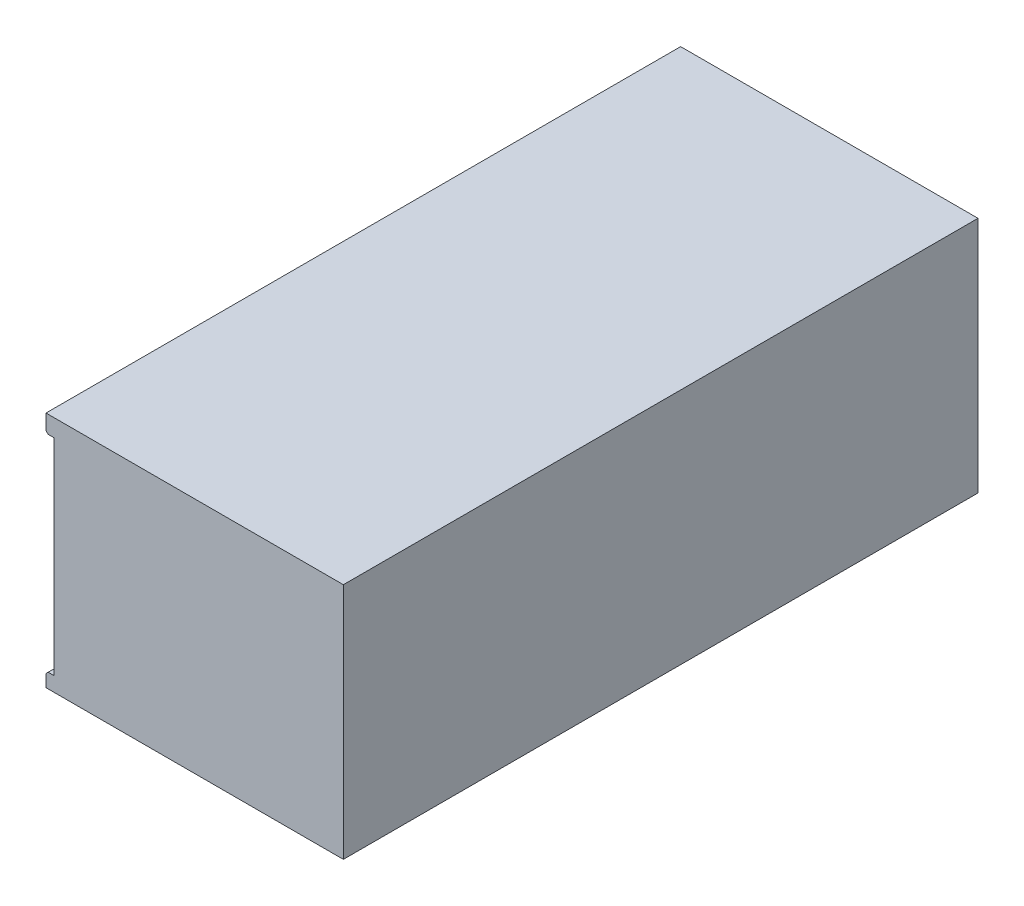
ISO-10303-21;
HEADER;
FILE_DESCRIPTION(('STEP AP214'),'2;1');
FILE_NAME('part.step','',(''),(''),'','','');
FILE_SCHEMA(('AUTOMOTIVE_DESIGN { 1 0 10303 214 1 1 1 1 }'));
ENDSEC;
DATA;
#1=APPLICATION_CONTEXT('core data for automotive mechanical design processes');
#2=APPLICATION_PROTOCOL_DEFINITION('international standard','automotive_design',2000,#1);
#3=PRODUCT_CONTEXT('',#1,'mechanical');
#4=PRODUCT('Part','Part','',(#3));
#5=PRODUCT_RELATED_PRODUCT_CATEGORY('part','',(#4));
#6=PRODUCT_DEFINITION_FORMATION('','',#4);
#7=PRODUCT_DEFINITION_CONTEXT('part definition',#1,'design');
#8=PRODUCT_DEFINITION('design','',#6,#7);
#9=PRODUCT_DEFINITION_SHAPE('','',#8);
#10=(LENGTH_UNIT() NAMED_UNIT(*) SI_UNIT(.MILLI.,.METRE.));
#11=(NAMED_UNIT(*) PLANE_ANGLE_UNIT() SI_UNIT($,.RADIAN.));
#12=(NAMED_UNIT(*) SI_UNIT($,.STERADIAN.) SOLID_ANGLE_UNIT());
#13=UNCERTAINTY_MEASURE_WITH_UNIT(LENGTH_MEASURE(1.E-05),#10,'distance_accuracy_value','');
#14=(GEOMETRIC_REPRESENTATION_CONTEXT(3) GLOBAL_UNCERTAINTY_ASSIGNED_CONTEXT((#13)) GLOBAL_UNIT_ASSIGNED_CONTEXT((#10,
#11,#12)) REPRESENTATION_CONTEXT('',''));
#15=CARTESIAN_POINT('',(0.,0.,0.));
#16=DIRECTION('',(0.,0.,1.));
#17=DIRECTION('',(1.,0.,0.));
#18=AXIS2_PLACEMENT_3D('',#15,#16,#17);
#19=CARTESIAN_POINT('',(-1.397,0.,55.5625));
#20=DIRECTION('',(0.,-1.,0.));
#21=DIRECTION('',(0.,0.,-1.));
#22=AXIS2_PLACEMENT_3D('',#19,#20,#21);
#23=PLANE('',#22);
#24=DIRECTION('',(-1.,0.,0.));
#25=VECTOR('',#24,1.);
#26=CARTESIAN_POINT('',(-1.397,0.,-55.5625));
#27=LINE('',#26,#25);
#28=CARTESIAN_POINT('',(50.673,0.,-55.5625));
#29=VERTEX_POINT('',#28);
#30=CARTESIAN_POINT('',(-1.397,0.,-55.5625));
#31=VERTEX_POINT('',#30);
#32=EDGE_CURVE('E240',#29,#31,#27,.T.);
#33=ORIENTED_EDGE('',*,*,#32,.T.);
#34=DIRECTION('',(0.,0.,-1.));
#35=VECTOR('',#34,1.);
#36=CARTESIAN_POINT('',(-1.397,0.,55.5625));
#37=LINE('',#36,#35);
#38=CARTESIAN_POINT('',(-1.397,0.,55.5625));
#39=VERTEX_POINT('',#38);
#40=EDGE_CURVE('E291',#39,#31,#37,.T.);
#41=ORIENTED_EDGE('',*,*,#40,.F.);
#42=DIRECTION('',(-1.,0.,0.));
#43=VECTOR('',#42,1.);
#44=CARTESIAN_POINT('',(-1.397,0.,55.5625));
#45=LINE('',#44,#43);
#46=CARTESIAN_POINT('',(50.673,0.,55.5625));
#47=VERTEX_POINT('',#46);
#48=EDGE_CURVE('E241',#47,#39,#45,.T.);
#49=ORIENTED_EDGE('',*,*,#48,.F.);
#50=DIRECTION('',(0.,0.,-1.));
#51=VECTOR('',#50,1.);
#52=CARTESIAN_POINT('',(50.673,0.,55.5625));
#53=LINE('',#52,#51);
#54=EDGE_CURVE('E260',#47,#29,#53,.T.);
#55=ORIENTED_EDGE('',*,*,#54,.T.);
#56=EDGE_LOOP('',(#33,#41,#49,#55));
#57=FACE_BOUND('',#56,.T.);
#58=ADVANCED_FACE('F37',(#57),#23,.F.);
#59=CARTESIAN_POINT('',(-1.397,-3.048,55.5625));
#60=DIRECTION('',(1.,0.,0.));
#61=DIRECTION('',(0.,0.,-1.));
#62=AXIS2_PLACEMENT_3D('',#59,#60,#61);
#63=PLANE('',#62);
#64=DIRECTION('',(0.,-1.,0.));
#65=VECTOR('',#64,1.);
#66=CARTESIAN_POINT('',(-1.397,-3.048,-55.5625));
#67=LINE('',#66,#65);
#68=CARTESIAN_POINT('',(-1.397,-2.66700000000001,-55.5625));
#69=VERTEX_POINT('',#68);
#70=EDGE_CURVE('E263',#31,#69,#67,.T.);
#71=ORIENTED_EDGE('',*,*,#70,.T.);
#72=DIRECTION('',(0.,0.,1.));
#73=VECTOR('',#72,1.);
#74=CARTESIAN_POINT('',(-1.397,-2.66700000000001,55.5625));
#75=LINE('',#74,#73);
#76=CARTESIAN_POINT('',(-1.397,-2.66700000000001,55.5625));
#77=VERTEX_POINT('',#76);
#78=EDGE_CURVE('E11',#69,#77,#75,.T.);
#79=ORIENTED_EDGE('',*,*,#78,.T.);
#80=DIRECTION('',(0.,-1.,0.));
#81=VECTOR('',#80,1.);
#82=CARTESIAN_POINT('',(-1.397,-3.048,55.5625));
#83=LINE('',#82,#81);
#84=EDGE_CURVE('E244',#39,#77,#83,.T.);
#85=ORIENTED_EDGE('',*,*,#84,.F.);
#86=ORIENTED_EDGE('',*,*,#40,.T.);
#87=EDGE_LOOP('',(#71,#79,#85,#86));
#88=FACE_BOUND('',#87,.T.);
#89=ADVANCED_FACE('F347',(#88),#63,.F.);
#90=CARTESIAN_POINT('',(0.,-3.048,55.5625));
#91=DIRECTION('',(0.,1.,0.));
#92=DIRECTION('',(0.,0.,1.));
#93=AXIS2_PLACEMENT_3D('',#90,#91,#92);
#94=PLANE('',#93);
#95=DIRECTION('',(1.,0.,0.));
#96=VECTOR('',#95,1.);
#97=CARTESIAN_POINT('',(0.,-3.048,55.5625));
#98=LINE('',#97,#96);
#99=CARTESIAN_POINT('',(-1.016,-3.048,55.5625));
#100=VERTEX_POINT('',#99);
#101=CARTESIAN_POINT('',(0.,-3.048,55.5625));
#102=VERTEX_POINT('',#101);
#103=EDGE_CURVE('E247',#100,#102,#98,.T.);
#104=ORIENTED_EDGE('',*,*,#103,.F.);
#105=DIRECTION('',(0.,0.,-1.));
#106=VECTOR('',#105,1.);
#107=CARTESIAN_POINT('',(-1.016,-3.048,55.5625));
#108=LINE('',#107,#106);
#109=CARTESIAN_POINT('',(-1.016,-3.048,-55.5625));
#110=VERTEX_POINT('',#109);
#111=EDGE_CURVE('E45',#100,#110,#108,.T.);
#112=ORIENTED_EDGE('',*,*,#111,.T.);
#113=DIRECTION('',(1.,0.,0.));
#114=VECTOR('',#113,1.);
#115=CARTESIAN_POINT('',(0.,-3.048,-55.5625));
#116=LINE('',#115,#114);
#117=CARTESIAN_POINT('',(0.,-3.048,-55.5625));
#118=VERTEX_POINT('',#117);
#119=EDGE_CURVE('E265',#110,#118,#116,.T.);
#120=ORIENTED_EDGE('',*,*,#119,.T.);
#121=DIRECTION('',(0.,0.,-1.));
#122=VECTOR('',#121,1.);
#123=CARTESIAN_POINT('',(0.,-3.048,55.5625));
#124=LINE('',#123,#122);
#125=EDGE_CURVE('E288',#102,#118,#124,.T.);
#126=ORIENTED_EDGE('',*,*,#125,.F.);
#127=EDGE_LOOP('',(#104,#112,#120,#126));
#128=FACE_BOUND('',#127,.T.);
#129=ADVANCED_FACE('F309',(#128),#94,.F.);
#130=CARTESIAN_POINT('',(0.,-39.116,55.5625));
#131=DIRECTION('',(1.,0.,0.));
#132=DIRECTION('',(0.,0.,-1.));
#133=AXIS2_PLACEMENT_3D('',#130,#131,#132);
#134=PLANE('',#133);
#135=CARTESIAN_POINT('',(0.,-6.34999999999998,-50.2666));
#136=DIRECTION('',(-1.,0.,0.));
#137=DIRECTION('',(0.,0.,1.));
#138=AXIS2_PLACEMENT_3D('',#135,#136,#137);
#139=CIRCLE('',#138,2.413);
#140=CARTESIAN_POINT('',(0.,-6.34999999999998,-47.8536));
#141=VERTEX_POINT('',#140);
#142=EDGE_CURVE('E153',#141,#141,#139,.T.);
#143=ORIENTED_EDGE('',*,*,#142,.F.);
#144=EDGE_LOOP('',(#143));
#145=FACE_BOUND('',#144,.T.);
#146=CARTESIAN_POINT('',(0.,-6.35000000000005,50.2666));
#147=DIRECTION('',(-1.,0.,0.));
#148=DIRECTION('',(0.,0.,1.));
#149=AXIS2_PLACEMENT_3D('',#146,#147,#148);
#150=CIRCLE('',#149,2.413);
#151=CARTESIAN_POINT('',(0.,-6.35000000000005,52.6796));
#152=VERTEX_POINT('',#151);
#153=EDGE_CURVE('E165',#152,#152,#150,.T.);
#154=ORIENTED_EDGE('',*,*,#153,.F.);
#155=EDGE_LOOP('',(#154));
#156=FACE_BOUND('',#155,.T.);
#157=CARTESIAN_POINT('',(0.,-6.35000000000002,4.8768));
#158=DIRECTION('',(-1.,0.,0.));
#159=DIRECTION('',(0.,0.,1.));
#160=AXIS2_PLACEMENT_3D('',#157,#158,#159);
#161=CIRCLE('',#160,2.413);
#162=CARTESIAN_POINT('',(0.,-6.35000000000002,7.28979999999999));
#163=VERTEX_POINT('',#162);
#164=EDGE_CURVE('E177',#163,#163,#161,.T.);
#165=ORIENTED_EDGE('',*,*,#164,.F.);
#166=EDGE_LOOP('',(#165));
#167=FACE_BOUND('',#166,.T.);
#168=CARTESIAN_POINT('',(0.,-6.35000000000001,-4.8768));
#169=DIRECTION('',(-1.,0.,0.));
#170=DIRECTION('',(0.,0.,1.));
#171=AXIS2_PLACEMENT_3D('',#168,#169,#170);
#172=CIRCLE('',#171,2.413);
#173=CARTESIAN_POINT('',(0.,-6.35000000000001,-2.4638));
#174=VERTEX_POINT('',#173);
#175=EDGE_CURVE('E189',#174,#174,#172,.T.);
#176=ORIENTED_EDGE('',*,*,#175,.F.);
#177=EDGE_LOOP('',(#176));
#178=FACE_BOUND('',#177,.T.);
#179=CARTESIAN_POINT('',(0.,-35.814,-50.2666));
#180=DIRECTION('',(-1.,0.,0.));
#181=DIRECTION('',(0.,0.,1.));
#182=AXIS2_PLACEMENT_3D('',#179,#180,#181);
#183=CIRCLE('',#182,2.413);
#184=CARTESIAN_POINT('',(0.,-35.814,-47.8536));
#185=VERTEX_POINT('',#184);
#186=EDGE_CURVE('E201',#185,#185,#183,.T.);
#187=ORIENTED_EDGE('',*,*,#186,.F.);
#188=EDGE_LOOP('',(#187));
#189=FACE_BOUND('',#188,.T.);
#190=CARTESIAN_POINT('',(0.,-35.814,-4.87680000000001));
#191=DIRECTION('',(-1.,0.,0.));
#192=DIRECTION('',(0.,0.,1.));
#193=AXIS2_PLACEMENT_3D('',#190,#191,#192);
#194=CIRCLE('',#193,2.413);
#195=CARTESIAN_POINT('',(0.,-35.814,-2.46380000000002));
#196=VERTEX_POINT('',#195);
#197=EDGE_CURVE('E213',#196,#196,#194,.T.);
#198=ORIENTED_EDGE('',*,*,#197,.F.);
#199=EDGE_LOOP('',(#198));
#200=FACE_BOUND('',#199,.T.);
#201=CARTESIAN_POINT('',(0.,-35.814,4.87679999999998));
#202=DIRECTION('',(-1.,0.,0.));
#203=DIRECTION('',(0.,0.,1.));
#204=AXIS2_PLACEMENT_3D('',#201,#202,#203);
#205=CIRCLE('',#204,2.413);
#206=CARTESIAN_POINT('',(0.,-35.814,7.28979999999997));
#207=VERTEX_POINT('',#206);
#208=EDGE_CURVE('E225',#207,#207,#205,.T.);
#209=ORIENTED_EDGE('',*,*,#208,.F.);
#210=EDGE_LOOP('',(#209));
#211=FACE_BOUND('',#210,.T.);
#212=CARTESIAN_POINT('',(0.,-35.814,50.2666));
#213=DIRECTION('',(-1.,0.,0.));
#214=DIRECTION('',(0.,0.,1.));
#215=AXIS2_PLACEMENT_3D('',#212,#213,#214);
#216=CIRCLE('',#215,2.413);
#217=CARTESIAN_POINT('',(0.,-35.814,52.6796));
#218=VERTEX_POINT('',#217);
#219=EDGE_CURVE('E237',#218,#218,#216,.T.);
#220=ORIENTED_EDGE('',*,*,#219,.F.);
#221=EDGE_LOOP('',(#220));
#222=FACE_BOUND('',#221,.T.);
#223=DIRECTION('',(0.,-1.,0.));
#224=VECTOR('',#223,1.);
#225=CARTESIAN_POINT('',(0.,-39.116,-55.5625));
#226=LINE('',#225,#224);
#227=CARTESIAN_POINT('',(0.,-39.116,-55.5625));
#228=VERTEX_POINT('',#227);
#229=EDGE_CURVE('E267',#118,#228,#226,.T.);
#230=ORIENTED_EDGE('',*,*,#229,.T.);
#231=DIRECTION('',(0.,0.,-1.));
#232=VECTOR('',#231,1.);
#233=CARTESIAN_POINT('',(0.,-39.116,55.5625));
#234=LINE('',#233,#232);
#235=CARTESIAN_POINT('',(0.,-39.116,55.5625));
#236=VERTEX_POINT('',#235);
#237=EDGE_CURVE('E285',#236,#228,#234,.T.);
#238=ORIENTED_EDGE('',*,*,#237,.F.);
#239=DIRECTION('',(0.,-1.,0.));
#240=VECTOR('',#239,1.);
#241=CARTESIAN_POINT('',(0.,-39.116,55.5625));
#242=LINE('',#241,#240);
#243=EDGE_CURVE('E249',#102,#236,#242,.T.);
#244=ORIENTED_EDGE('',*,*,#243,.F.);
#245=ORIENTED_EDGE('',*,*,#125,.T.);
#246=EDGE_LOOP('',(#230,#238,#244,#245));
#247=FACE_BOUND('',#246,.T.);
#248=ADVANCED_FACE('F319',(#145,#156,#167,#178,#189,#200,#211,#222,#247),#134,.F.);
#249=CARTESIAN_POINT('',(-1.397,-39.116,55.5625));
#250=DIRECTION('',(0.,-1.,0.));
#251=DIRECTION('',(0.,0.,-1.));
#252=AXIS2_PLACEMENT_3D('',#249,#250,#251);
#253=PLANE('',#252);
#254=DIRECTION('',(-1.,0.,0.));
#255=VECTOR('',#254,1.);
#256=CARTESIAN_POINT('',(-1.397,-39.116,-55.5625));
#257=LINE('',#256,#255);
#258=CARTESIAN_POINT('',(-1.01599999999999,-39.116,-55.5625));
#259=VERTEX_POINT('',#258);
#260=EDGE_CURVE('E269',#228,#259,#257,.T.);
#261=ORIENTED_EDGE('',*,*,#260,.T.);
#262=DIRECTION('',(0.,0.,1.));
#263=VECTOR('',#262,1.);
#264=CARTESIAN_POINT('',(-1.01599999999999,-39.116,55.5625));
#265=LINE('',#264,#263);
#266=CARTESIAN_POINT('',(-1.01599999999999,-39.116,55.5625));
#267=VERTEX_POINT('',#266);
#268=EDGE_CURVE('E301',#259,#267,#265,.T.);
#269=ORIENTED_EDGE('',*,*,#268,.T.);
#270=DIRECTION('',(-1.,0.,0.));
#271=VECTOR('',#270,1.);
#272=CARTESIAN_POINT('',(-1.397,-39.116,55.5625));
#273=LINE('',#272,#271);
#274=EDGE_CURVE('E251',#236,#267,#273,.T.);
#275=ORIENTED_EDGE('',*,*,#274,.F.);
#276=ORIENTED_EDGE('',*,*,#237,.T.);
#277=EDGE_LOOP('',(#261,#269,#275,#276));
#278=FACE_BOUND('',#277,.T.);
#279=ADVANCED_FACE('F323',(#278),#253,.F.);
#280=CARTESIAN_POINT('',(-1.397,-41.656,55.5625));
#281=DIRECTION('',(1.,0.,0.));
#282=DIRECTION('',(0.,0.,-1.));
#283=AXIS2_PLACEMENT_3D('',#280,#281,#282);
#284=PLANE('',#283);
#285=DIRECTION('',(0.,-1.,0.));
#286=VECTOR('',#285,1.);
#287=CARTESIAN_POINT('',(-1.397,-41.656,55.5625));
#288=LINE('',#287,#286);
#289=CARTESIAN_POINT('',(-1.397,-39.497,55.5625));
#290=VERTEX_POINT('',#289);
#291=CARTESIAN_POINT('',(-1.397,-41.656,55.5625));
#292=VERTEX_POINT('',#291);
#293=EDGE_CURVE('E254',#290,#292,#288,.T.);
#294=ORIENTED_EDGE('',*,*,#293,.F.);
#295=DIRECTION('',(0.,0.,-1.));
#296=VECTOR('',#295,1.);
#297=CARTESIAN_POINT('',(-1.397,-39.497,55.5625));
#298=LINE('',#297,#296);
#299=CARTESIAN_POINT('',(-1.397,-39.497,-55.5625));
#300=VERTEX_POINT('',#299);
#301=EDGE_CURVE('E294',#290,#300,#298,.T.);
#302=ORIENTED_EDGE('',*,*,#301,.T.);
#303=DIRECTION('',(0.,-1.,0.));
#304=VECTOR('',#303,1.);
#305=CARTESIAN_POINT('',(-1.397,-41.656,-55.5625));
#306=LINE('',#305,#304);
#307=CARTESIAN_POINT('',(-1.397,-41.656,-55.5625));
#308=VERTEX_POINT('',#307);
#309=EDGE_CURVE('E272',#300,#308,#306,.T.);
#310=ORIENTED_EDGE('',*,*,#309,.T.);
#311=DIRECTION('',(0.,0.,-1.));
#312=VECTOR('',#311,1.);
#313=CARTESIAN_POINT('',(-1.397,-41.656,55.5625));
#314=LINE('',#313,#312);
#315=EDGE_CURVE('E282',#292,#308,#314,.T.);
#316=ORIENTED_EDGE('',*,*,#315,.F.);
#317=EDGE_LOOP('',(#294,#302,#310,#316));
#318=FACE_BOUND('',#317,.T.);
#319=ADVANCED_FACE('F331',(#318),#284,.F.);
#320=CARTESIAN_POINT('',(50.673,-41.656,55.5625));
#321=DIRECTION('',(0.,1.,0.));
#322=DIRECTION('',(-1.,0.,0.));
#323=AXIS2_PLACEMENT_3D('',#320,#321,#322);
#324=PLANE('',#323);
#325=DIRECTION('',(1.,0.,0.));
#326=VECTOR('',#325,1.);
#327=CARTESIAN_POINT('',(50.673,-41.656,-55.5625));
#328=LINE('',#327,#326);
#329=CARTESIAN_POINT('',(50.673,-41.656,-55.5625));
#330=VERTEX_POINT('',#329);
#331=EDGE_CURVE('E274',#308,#330,#328,.T.);
#332=ORIENTED_EDGE('',*,*,#331,.T.);
#333=DIRECTION('',(0.,0.,-1.));
#334=VECTOR('',#333,1.);
#335=CARTESIAN_POINT('',(50.673,-41.656,55.5625));
#336=LINE('',#335,#334);
#337=CARTESIAN_POINT('',(50.673,-41.656,55.5625));
#338=VERTEX_POINT('',#337);
#339=EDGE_CURVE('E279',#338,#330,#336,.T.);
#340=ORIENTED_EDGE('',*,*,#339,.F.);
#341=DIRECTION('',(1.,0.,0.));
#342=VECTOR('',#341,1.);
#343=CARTESIAN_POINT('',(50.673,-41.656,55.5625));
#344=LINE('',#343,#342);
#345=EDGE_CURVE('E256',#292,#338,#344,.T.);
#346=ORIENTED_EDGE('',*,*,#345,.F.);
#347=ORIENTED_EDGE('',*,*,#315,.T.);
#348=EDGE_LOOP('',(#332,#340,#346,#347));
#349=FACE_BOUND('',#348,.T.);
#350=ADVANCED_FACE('F338',(#349),#324,.F.);
#351=CARTESIAN_POINT('',(50.673,0.,55.5625));
#352=DIRECTION('',(-1.,0.,0.));
#353=DIRECTION('',(0.,-1.,0.));
#354=AXIS2_PLACEMENT_3D('',#351,#352,#353);
#355=PLANE('',#354);
#356=DIRECTION('',(0.,1.,0.));
#357=VECTOR('',#356,1.);
#358=CARTESIAN_POINT('',(50.673,0.,-55.5625));
#359=LINE('',#358,#357);
#360=EDGE_CURVE('E245',#330,#29,#359,.T.);
#361=ORIENTED_EDGE('',*,*,#360,.T.);
#362=ORIENTED_EDGE('',*,*,#54,.F.);
#363=DIRECTION('',(0.,1.,0.));
#364=VECTOR('',#363,1.);
#365=CARTESIAN_POINT('',(50.673,0.,55.5625));
#366=LINE('',#365,#364);
#367=EDGE_CURVE('E258',#338,#47,#366,.T.);
#368=ORIENTED_EDGE('',*,*,#367,.F.);
#369=ORIENTED_EDGE('',*,*,#339,.T.);
#370=EDGE_LOOP('',(#361,#362,#368,#369));
#371=FACE_BOUND('',#370,.T.);
#372=ADVANCED_FACE('F342',(#371),#355,.F.);
#373=CARTESIAN_POINT('',(-1.397,0.,55.5625));
#374=DIRECTION('',(0.,0.,1.));
#375=DIRECTION('',(1.,0.,0.));
#376=AXIS2_PLACEMENT_3D('',#373,#374,#375);
#377=PLANE('',#376);
#378=ORIENTED_EDGE('',*,*,#274,.T.);
#379=DIRECTION('',(0.707106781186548,0.707106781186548,0.));
#380=VECTOR('',#379,1.);
#381=CARTESIAN_POINT('',(18.3515,-19.7485,55.5625));
#382=LINE('',#381,#380);
#383=EDGE_CURVE('E304',#267,#290,#382,.F.);
#384=ORIENTED_EDGE('',*,*,#383,.T.);
#385=ORIENTED_EDGE('',*,*,#293,.T.);
#386=ORIENTED_EDGE('',*,*,#345,.T.);
#387=ORIENTED_EDGE('',*,*,#367,.T.);
#388=ORIENTED_EDGE('',*,*,#48,.T.);
#389=ORIENTED_EDGE('',*,*,#84,.T.);
#390=DIRECTION('',(-0.707106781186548,0.707106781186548,0.));
#391=VECTOR('',#390,1.);
#392=CARTESIAN_POINT('',(-2.7305,-1.3335,55.5625));
#393=LINE('',#392,#391);
#394=EDGE_CURVE('E52',#77,#100,#393,.F.);
#395=ORIENTED_EDGE('',*,*,#394,.T.);
#396=ORIENTED_EDGE('',*,*,#103,.T.);
#397=ORIENTED_EDGE('',*,*,#243,.T.);
#398=EDGE_LOOP('',(#378,#384,#385,#386,#387,#388,#389,#395,#396,#397));
#399=FACE_BOUND('',#398,.T.);
#400=ADVANCED_FACE('F326',(#399),#377,.T.);
#401=CARTESIAN_POINT('',(-1.397,0.,-55.5625));
#402=DIRECTION('',(0.,0.,1.));
#403=DIRECTION('',(1.,0.,0.));
#404=AXIS2_PLACEMENT_3D('',#401,#402,#403);
#405=PLANE('',#404);
#406=ORIENTED_EDGE('',*,*,#309,.F.);
#407=DIRECTION('',(-0.707106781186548,-0.707106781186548,0.));
#408=VECTOR('',#407,1.);
#409=CARTESIAN_POINT('',(-1.397,-39.497,-55.5625));
#410=LINE('',#409,#408);
#411=EDGE_CURVE('E299',#300,#259,#410,.F.);
#412=ORIENTED_EDGE('',*,*,#411,.T.);
#413=ORIENTED_EDGE('',*,*,#260,.F.);
#414=ORIENTED_EDGE('',*,*,#229,.F.);
#415=ORIENTED_EDGE('',*,*,#119,.F.);
#416=DIRECTION('',(0.707106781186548,-0.707106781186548,0.));
#417=VECTOR('',#416,1.);
#418=CARTESIAN_POINT('',(-1.016,-3.048,-55.5625));
#419=LINE('',#418,#417);
#420=EDGE_CURVE('E297',#110,#69,#419,.F.);
#421=ORIENTED_EDGE('',*,*,#420,.T.);
#422=ORIENTED_EDGE('',*,*,#70,.F.);
#423=ORIENTED_EDGE('',*,*,#32,.F.);
#424=ORIENTED_EDGE('',*,*,#360,.F.);
#425=ORIENTED_EDGE('',*,*,#331,.F.);
#426=EDGE_LOOP('',(#406,#412,#413,#414,#415,#421,#422,#423,#424,#425));
#427=FACE_BOUND('',#426,.T.);
#428=ADVANCED_FACE('F315',(#427),#405,.F.);
#429=CARTESIAN_POINT('',(0.,-35.814,50.2666));
#430=DIRECTION('',(-1.,0.,0.));
#431=DIRECTION('',(0.,0.,1.));
#432=AXIS2_PLACEMENT_3D('',#429,#430,#431);
#433=CYLINDRICAL_SURFACE('',#432,2.413);
#434=CARTESIAN_POINT('',(7.62000000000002,-35.814,50.2666));
#435=DIRECTION('',(-1.,0.,0.));
#436=DIRECTION('',(0.,0.,1.));
#437=AXIS2_PLACEMENT_3D('',#434,#435,#436);
#438=CIRCLE('',#437,2.413);
#439=CARTESIAN_POINT('',(7.62000000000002,-35.814,52.6796));
#440=VERTEX_POINT('',#439);
#441=EDGE_CURVE('E234',#440,#440,#438,.T.);
#442=ORIENTED_EDGE('',*,*,#441,.F.);
#443=EDGE_LOOP('',(#442));
#444=FACE_BOUND('',#443,.T.);
#445=ORIENTED_EDGE('',*,*,#219,.T.);
#446=EDGE_LOOP('',(#445));
#447=FACE_BOUND('',#446,.T.);
#448=ADVANCED_FACE('F374',(#444,#447),#433,.F.);
#449=CARTESIAN_POINT('',(7.62000000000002,-33.7947000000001,50.2666));
#450=DIRECTION('',(1.,0.,0.));
#451=DIRECTION('',(0.,0.,-1.));
#452=AXIS2_PLACEMENT_3D('',#449,#450,#451);
#453=PLANE('',#452);
#454=CARTESIAN_POINT('',(7.62000000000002,-35.814,50.2666));
#455=DIRECTION('',(-1.,0.,0.));
#456=DIRECTION('',(0.,0.,1.));
#457=AXIS2_PLACEMENT_3D('',#454,#455,#456);
#458=CIRCLE('',#457,2.01929999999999);
#459=CARTESIAN_POINT('',(7.62000000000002,-35.814,52.2859));
#460=VERTEX_POINT('',#459);
#461=EDGE_CURVE('E231',#460,#460,#458,.T.);
#462=ORIENTED_EDGE('',*,*,#461,.F.);
#463=EDGE_LOOP('',(#462));
#464=FACE_BOUND('',#463,.T.);
#465=ORIENTED_EDGE('',*,*,#441,.T.);
#466=EDGE_LOOP('',(#465));
#467=FACE_BOUND('',#466,.T.);
#468=ADVANCED_FACE('F379',(#464,#467),#453,.F.);
#469=CARTESIAN_POINT('',(0.,-35.814,50.2666));
#470=DIRECTION('',(-1.,0.,0.));
#471=DIRECTION('',(0.,0.,1.));
#472=AXIS2_PLACEMENT_3D('',#469,#470,#471);
#473=CYLINDRICAL_SURFACE('',#472,2.01929999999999);
#474=CARTESIAN_POINT('',(9.99744000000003,-35.814,50.2666));
#475=DIRECTION('',(-1.,0.,0.));
#476=DIRECTION('',(0.,0.,1.));
#477=AXIS2_PLACEMENT_3D('',#474,#475,#476);
#478=CIRCLE('',#477,2.01929999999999);
#479=CARTESIAN_POINT('',(9.99744000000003,-35.814,52.2859));
#480=VERTEX_POINT('',#479);
#481=EDGE_CURVE('E228',#480,#480,#478,.T.);
#482=ORIENTED_EDGE('',*,*,#481,.F.);
#483=EDGE_LOOP('',(#482));
#484=FACE_BOUND('',#483,.T.);
#485=ORIENTED_EDGE('',*,*,#461,.T.);
#486=EDGE_LOOP('',(#485));
#487=FACE_BOUND('',#486,.T.);
#488=ADVANCED_FACE('F383',(#484,#487),#473,.F.);
#489=CARTESIAN_POINT('',(9.99744000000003,-35.814,50.2666));
#490=DIRECTION('',(-1.,0.,0.));
#491=DIRECTION('',(0.,0.,1.));
#492=AXIS2_PLACEMENT_3D('',#489,#490,#491);
#493=CONICAL_SURFACE('',#492,2.01929999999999,1.02974425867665);
#494=CARTESIAN_POINT('',(11.2107578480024,-35.814,50.2666));
#495=VERTEX_POINT('',#494);
#496=VERTEX_LOOP('',#495);
#497=FACE_BOUND('',#496,.T.);
#498=ORIENTED_EDGE('',*,*,#481,.T.);
#499=EDGE_LOOP('',(#498));
#500=FACE_BOUND('',#499,.T.);
#501=ADVANCED_FACE('F387',(#497,#500),#493,.F.);
#502=CARTESIAN_POINT('',(0.,-35.814,4.87679999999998));
#503=DIRECTION('',(-1.,0.,0.));
#504=DIRECTION('',(0.,0.,1.));
#505=AXIS2_PLACEMENT_3D('',#502,#503,#504);
#506=CYLINDRICAL_SURFACE('',#505,2.413);
#507=CARTESIAN_POINT('',(7.62000000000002,-35.814,4.87679999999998));
#508=DIRECTION('',(-1.,0.,0.));
#509=DIRECTION('',(0.,0.,1.));
#510=AXIS2_PLACEMENT_3D('',#507,#508,#509);
#511=CIRCLE('',#510,2.413);
#512=CARTESIAN_POINT('',(7.62000000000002,-35.814,7.28979999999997));
#513=VERTEX_POINT('',#512);
#514=EDGE_CURVE('E222',#513,#513,#511,.T.);
#515=ORIENTED_EDGE('',*,*,#514,.F.);
#516=EDGE_LOOP('',(#515));
#517=FACE_BOUND('',#516,.T.);
#518=ORIENTED_EDGE('',*,*,#208,.T.);
#519=EDGE_LOOP('',(#518));
#520=FACE_BOUND('',#519,.T.);
#521=ADVANCED_FACE('F391',(#517,#520),#506,.F.);
#522=CARTESIAN_POINT('',(7.62000000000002,-33.7947,4.87679999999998));
#523=DIRECTION('',(1.,0.,0.));
#524=DIRECTION('',(0.,0.,-1.));
#525=AXIS2_PLACEMENT_3D('',#522,#523,#524);
#526=PLANE('',#525);
#527=CARTESIAN_POINT('',(7.62000000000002,-35.814,4.87679999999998));
#528=DIRECTION('',(-1.,0.,0.));
#529=DIRECTION('',(0.,0.,1.));
#530=AXIS2_PLACEMENT_3D('',#527,#528,#529);
#531=CIRCLE('',#530,2.0193);
#532=CARTESIAN_POINT('',(7.62000000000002,-35.814,6.89609999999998));
#533=VERTEX_POINT('',#532);
#534=EDGE_CURVE('E219',#533,#533,#531,.T.);
#535=ORIENTED_EDGE('',*,*,#534,.F.);
#536=EDGE_LOOP('',(#535));
#537=FACE_BOUND('',#536,.T.);
#538=ORIENTED_EDGE('',*,*,#514,.T.);
#539=EDGE_LOOP('',(#538));
#540=FACE_BOUND('',#539,.T.);
#541=ADVANCED_FACE('F395',(#537,#540),#526,.F.);
#542=CARTESIAN_POINT('',(0.,-35.814,4.87679999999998));
#543=DIRECTION('',(-1.,0.,0.));
#544=DIRECTION('',(0.,0.,1.));
#545=AXIS2_PLACEMENT_3D('',#542,#543,#544);
#546=CYLINDRICAL_SURFACE('',#545,2.0193);
#547=CARTESIAN_POINT('',(9.99744000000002,-35.814,4.87679999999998));
#548=DIRECTION('',(-1.,0.,0.));
#549=DIRECTION('',(0.,0.,1.));
#550=AXIS2_PLACEMENT_3D('',#547,#548,#549);
#551=CIRCLE('',#550,2.01929999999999);
#552=CARTESIAN_POINT('',(9.99744000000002,-35.814,6.89609999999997));
#553=VERTEX_POINT('',#552);
#554=EDGE_CURVE('E216',#553,#553,#551,.T.);
#555=ORIENTED_EDGE('',*,*,#554,.F.);
#556=EDGE_LOOP('',(#555));
#557=FACE_BOUND('',#556,.T.);
#558=ORIENTED_EDGE('',*,*,#534,.T.);
#559=EDGE_LOOP('',(#558));
#560=FACE_BOUND('',#559,.T.);
#561=ADVANCED_FACE('F399',(#557,#560),#546,.F.);
#562=CARTESIAN_POINT('',(9.99744000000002,-35.814,4.87679999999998));
#563=DIRECTION('',(-1.,0.,0.));
#564=DIRECTION('',(0.,0.,1.));
#565=AXIS2_PLACEMENT_3D('',#562,#563,#564);
#566=CONICAL_SURFACE('',#565,2.01929999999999,1.02974425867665);
#567=CARTESIAN_POINT('',(11.2107578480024,-35.814,4.87679999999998));
#568=VERTEX_POINT('',#567);
#569=VERTEX_LOOP('',#568);
#570=FACE_BOUND('',#569,.T.);
#571=ORIENTED_EDGE('',*,*,#554,.T.);
#572=EDGE_LOOP('',(#571));
#573=FACE_BOUND('',#572,.T.);
#574=ADVANCED_FACE('F403',(#570,#573),#566,.F.);
#575=CARTESIAN_POINT('',(0.,-35.814,-4.87680000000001));
#576=DIRECTION('',(-1.,0.,0.));
#577=DIRECTION('',(0.,0.,1.));
#578=AXIS2_PLACEMENT_3D('',#575,#576,#577);
#579=CYLINDRICAL_SURFACE('',#578,2.413);
#580=CARTESIAN_POINT('',(7.62000000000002,-35.814,-4.87680000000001));
#581=DIRECTION('',(-1.,0.,0.));
#582=DIRECTION('',(0.,0.,1.));
#583=AXIS2_PLACEMENT_3D('',#580,#581,#582);
#584=CIRCLE('',#583,2.413);
#585=CARTESIAN_POINT('',(7.62000000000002,-35.814,-2.46380000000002));
#586=VERTEX_POINT('',#585);
#587=EDGE_CURVE('E210',#586,#586,#584,.T.);
#588=ORIENTED_EDGE('',*,*,#587,.F.);
#589=EDGE_LOOP('',(#588));
#590=FACE_BOUND('',#589,.T.);
#591=ORIENTED_EDGE('',*,*,#197,.T.);
#592=EDGE_LOOP('',(#591));
#593=FACE_BOUND('',#592,.T.);
#594=ADVANCED_FACE('F407',(#590,#593),#579,.F.);
#595=CARTESIAN_POINT('',(7.62000000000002,-33.7947,-4.87680000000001));
#596=DIRECTION('',(1.,0.,0.));
#597=DIRECTION('',(0.,0.,-1.));
#598=AXIS2_PLACEMENT_3D('',#595,#596,#597);
#599=PLANE('',#598);
#600=CARTESIAN_POINT('',(7.62000000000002,-35.814,-4.87680000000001));
#601=DIRECTION('',(-1.,0.,0.));
#602=DIRECTION('',(0.,0.,1.));
#603=AXIS2_PLACEMENT_3D('',#600,#601,#602);
#604=CIRCLE('',#603,2.0193);
#605=CARTESIAN_POINT('',(7.62000000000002,-35.814,-2.85750000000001));
#606=VERTEX_POINT('',#605);
#607=EDGE_CURVE('E207',#606,#606,#604,.T.);
#608=ORIENTED_EDGE('',*,*,#607,.F.);
#609=EDGE_LOOP('',(#608));
#610=FACE_BOUND('',#609,.T.);
#611=ORIENTED_EDGE('',*,*,#587,.T.);
#612=EDGE_LOOP('',(#611));
#613=FACE_BOUND('',#612,.T.);
#614=ADVANCED_FACE('F411',(#610,#613),#599,.F.);
#615=CARTESIAN_POINT('',(0.,-35.814,-4.87680000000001));
#616=DIRECTION('',(-1.,0.,0.));
#617=DIRECTION('',(0.,0.,1.));
#618=AXIS2_PLACEMENT_3D('',#615,#616,#617);
#619=CYLINDRICAL_SURFACE('',#618,2.0193);
#620=CARTESIAN_POINT('',(9.99744000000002,-35.814,-4.87680000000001));
#621=DIRECTION('',(-1.,0.,0.));
#622=DIRECTION('',(0.,0.,1.));
#623=AXIS2_PLACEMENT_3D('',#620,#621,#622);
#624=CIRCLE('',#623,2.01929999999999);
#625=CARTESIAN_POINT('',(9.99744000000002,-35.814,-2.85750000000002));
#626=VERTEX_POINT('',#625);
#627=EDGE_CURVE('E204',#626,#626,#624,.T.);
#628=ORIENTED_EDGE('',*,*,#627,.F.);
#629=EDGE_LOOP('',(#628));
#630=FACE_BOUND('',#629,.T.);
#631=ORIENTED_EDGE('',*,*,#607,.T.);
#632=EDGE_LOOP('',(#631));
#633=FACE_BOUND('',#632,.T.);
#634=ADVANCED_FACE('F415',(#630,#633),#619,.F.);
#635=CARTESIAN_POINT('',(9.99744000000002,-35.814,-4.87680000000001));
#636=DIRECTION('',(-1.,0.,0.));
#637=DIRECTION('',(0.,0.,1.));
#638=AXIS2_PLACEMENT_3D('',#635,#636,#637);
#639=CONICAL_SURFACE('',#638,2.01929999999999,1.02974425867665);
#640=CARTESIAN_POINT('',(11.2107578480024,-35.814,-4.87680000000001));
#641=VERTEX_POINT('',#640);
#642=VERTEX_LOOP('',#641);
#643=FACE_BOUND('',#642,.T.);
#644=ORIENTED_EDGE('',*,*,#627,.T.);
#645=EDGE_LOOP('',(#644));
#646=FACE_BOUND('',#645,.T.);
#647=ADVANCED_FACE('F419',(#643,#646),#639,.F.);
#648=CARTESIAN_POINT('',(0.,-35.814,-50.2666));
#649=DIRECTION('',(-1.,0.,0.));
#650=DIRECTION('',(0.,0.,1.));
#651=AXIS2_PLACEMENT_3D('',#648,#649,#650);
#652=CYLINDRICAL_SURFACE('',#651,2.413);
#653=CARTESIAN_POINT('',(7.62000000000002,-35.814,-50.2666));
#654=DIRECTION('',(-1.,0.,0.));
#655=DIRECTION('',(0.,0.,1.));
#656=AXIS2_PLACEMENT_3D('',#653,#654,#655);
#657=CIRCLE('',#656,2.413);
#658=CARTESIAN_POINT('',(7.62000000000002,-35.814,-47.8536));
#659=VERTEX_POINT('',#658);
#660=EDGE_CURVE('E198',#659,#659,#657,.T.);
#661=ORIENTED_EDGE('',*,*,#660,.F.);
#662=EDGE_LOOP('',(#661));
#663=FACE_BOUND('',#662,.T.);
#664=ORIENTED_EDGE('',*,*,#186,.T.);
#665=EDGE_LOOP('',(#664));
#666=FACE_BOUND('',#665,.T.);
#667=ADVANCED_FACE('F423',(#663,#666),#652,.F.);
#668=CARTESIAN_POINT('',(7.62000000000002,-33.7947,-50.2666));
#669=DIRECTION('',(1.,0.,0.));
#670=DIRECTION('',(0.,0.,-1.));
#671=AXIS2_PLACEMENT_3D('',#668,#669,#670);
#672=PLANE('',#671);
#673=CARTESIAN_POINT('',(7.62000000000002,-35.814,-50.2666));
#674=DIRECTION('',(-1.,0.,0.));
#675=DIRECTION('',(0.,0.,1.));
#676=AXIS2_PLACEMENT_3D('',#673,#674,#675);
#677=CIRCLE('',#676,2.01929999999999);
#678=CARTESIAN_POINT('',(7.62000000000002,-35.814,-48.2473));
#679=VERTEX_POINT('',#678);
#680=EDGE_CURVE('E195',#679,#679,#677,.T.);
#681=ORIENTED_EDGE('',*,*,#680,.F.);
#682=EDGE_LOOP('',(#681));
#683=FACE_BOUND('',#682,.T.);
#684=ORIENTED_EDGE('',*,*,#660,.T.);
#685=EDGE_LOOP('',(#684));
#686=FACE_BOUND('',#685,.T.);
#687=ADVANCED_FACE('F427',(#683,#686),#672,.F.);
#688=CARTESIAN_POINT('',(0.,-35.814,-50.2666));
#689=DIRECTION('',(-1.,0.,0.));
#690=DIRECTION('',(0.,0.,1.));
#691=AXIS2_PLACEMENT_3D('',#688,#689,#690);
#692=CYLINDRICAL_SURFACE('',#691,2.01929999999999);
#693=CARTESIAN_POINT('',(9.99744000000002,-35.814,-50.2666));
#694=DIRECTION('',(-1.,0.,0.));
#695=DIRECTION('',(0.,0.,1.));
#696=AXIS2_PLACEMENT_3D('',#693,#694,#695);
#697=CIRCLE('',#696,2.01929999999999);
#698=CARTESIAN_POINT('',(9.99744000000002,-35.814,-48.2473));
#699=VERTEX_POINT('',#698);
#700=EDGE_CURVE('E192',#699,#699,#697,.T.);
#701=ORIENTED_EDGE('',*,*,#700,.F.);
#702=EDGE_LOOP('',(#701));
#703=FACE_BOUND('',#702,.T.);
#704=ORIENTED_EDGE('',*,*,#680,.T.);
#705=EDGE_LOOP('',(#704));
#706=FACE_BOUND('',#705,.T.);
#707=ADVANCED_FACE('F431',(#703,#706),#692,.F.);
#708=CARTESIAN_POINT('',(9.99744000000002,-35.814,-50.2666));
#709=DIRECTION('',(-1.,0.,0.));
#710=DIRECTION('',(0.,0.,1.));
#711=AXIS2_PLACEMENT_3D('',#708,#709,#710);
#712=CONICAL_SURFACE('',#711,2.01929999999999,1.02974425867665);
#713=CARTESIAN_POINT('',(11.2107578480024,-35.814,-50.2666));
#714=VERTEX_POINT('',#713);
#715=VERTEX_LOOP('',#714);
#716=FACE_BOUND('',#715,.T.);
#717=ORIENTED_EDGE('',*,*,#700,.T.);
#718=EDGE_LOOP('',(#717));
#719=FACE_BOUND('',#718,.T.);
#720=ADVANCED_FACE('F435',(#716,#719),#712,.F.);
#721=CARTESIAN_POINT('',(0.,-6.35000000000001,-4.8768));
#722=DIRECTION('',(-1.,0.,0.));
#723=DIRECTION('',(0.,0.,1.));
#724=AXIS2_PLACEMENT_3D('',#721,#722,#723);
#725=CYLINDRICAL_SURFACE('',#724,2.413);
#726=CARTESIAN_POINT('',(7.62,-6.35000000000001,-4.8768));
#727=DIRECTION('',(-1.,0.,0.));
#728=DIRECTION('',(0.,0.,1.));
#729=AXIS2_PLACEMENT_3D('',#726,#727,#728);
#730=CIRCLE('',#729,2.413);
#731=CARTESIAN_POINT('',(7.62,-6.35000000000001,-2.46380000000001));
#732=VERTEX_POINT('',#731);
#733=EDGE_CURVE('E186',#732,#732,#730,.T.);
#734=ORIENTED_EDGE('',*,*,#733,.F.);
#735=EDGE_LOOP('',(#734));
#736=FACE_BOUND('',#735,.T.);
#737=ORIENTED_EDGE('',*,*,#175,.T.);
#738=EDGE_LOOP('',(#737));
#739=FACE_BOUND('',#738,.T.);
#740=ADVANCED_FACE('F439',(#736,#739),#725,.F.);
#741=CARTESIAN_POINT('',(7.62,-4.33070000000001,-4.8768));
#742=DIRECTION('',(1.,0.,0.));
#743=DIRECTION('',(0.,0.,-1.));
#744=AXIS2_PLACEMENT_3D('',#741,#742,#743);
#745=PLANE('',#744);
#746=CARTESIAN_POINT('',(7.62,-6.35000000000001,-4.8768));
#747=DIRECTION('',(-1.,0.,0.));
#748=DIRECTION('',(0.,0.,1.));
#749=AXIS2_PLACEMENT_3D('',#746,#747,#748);
#750=CIRCLE('',#749,2.0193);
#751=CARTESIAN_POINT('',(7.62,-6.35000000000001,-2.8575));
#752=VERTEX_POINT('',#751);
#753=EDGE_CURVE('E183',#752,#752,#750,.T.);
#754=ORIENTED_EDGE('',*,*,#753,.F.);
#755=EDGE_LOOP('',(#754));
#756=FACE_BOUND('',#755,.T.);
#757=ORIENTED_EDGE('',*,*,#733,.T.);
#758=EDGE_LOOP('',(#757));
#759=FACE_BOUND('',#758,.T.);
#760=ADVANCED_FACE('F443',(#756,#759),#745,.F.);
#761=CARTESIAN_POINT('',(0.,-6.35000000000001,-4.8768));
#762=DIRECTION('',(-1.,0.,0.));
#763=DIRECTION('',(0.,0.,1.));
#764=AXIS2_PLACEMENT_3D('',#761,#762,#763);
#765=CYLINDRICAL_SURFACE('',#764,2.0193);
#766=CARTESIAN_POINT('',(9.99744,-6.35000000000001,-4.8768));
#767=DIRECTION('',(-1.,0.,0.));
#768=DIRECTION('',(0.,0.,1.));
#769=AXIS2_PLACEMENT_3D('',#766,#767,#768);
#770=CIRCLE('',#769,2.0193);
#771=CARTESIAN_POINT('',(9.99744,-6.35000000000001,-2.85750000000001));
#772=VERTEX_POINT('',#771);
#773=EDGE_CURVE('E180',#772,#772,#770,.T.);
#774=ORIENTED_EDGE('',*,*,#773,.F.);
#775=EDGE_LOOP('',(#774));
#776=FACE_BOUND('',#775,.T.);
#777=ORIENTED_EDGE('',*,*,#753,.T.);
#778=EDGE_LOOP('',(#777));
#779=FACE_BOUND('',#778,.T.);
#780=ADVANCED_FACE('F447',(#776,#779),#765,.F.);
#781=CARTESIAN_POINT('',(9.99744,-6.35000000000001,-4.8768));
#782=DIRECTION('',(-1.,0.,0.));
#783=DIRECTION('',(0.,0.,1.));
#784=AXIS2_PLACEMENT_3D('',#781,#782,#783);
#785=CONICAL_SURFACE('',#784,2.0193,1.02974425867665);
#786=CARTESIAN_POINT('',(11.2107578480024,-6.35000000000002,-4.8768));
#787=VERTEX_POINT('',#786);
#788=VERTEX_LOOP('',#787);
#789=FACE_BOUND('',#788,.T.);
#790=ORIENTED_EDGE('',*,*,#773,.T.);
#791=EDGE_LOOP('',(#790));
#792=FACE_BOUND('',#791,.T.);
#793=ADVANCED_FACE('F451',(#789,#792),#785,.F.);
#794=CARTESIAN_POINT('',(0.,-6.35000000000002,4.8768));
#795=DIRECTION('',(-1.,0.,0.));
#796=DIRECTION('',(0.,0.,1.));
#797=AXIS2_PLACEMENT_3D('',#794,#795,#796);
#798=CYLINDRICAL_SURFACE('',#797,2.413);
#799=CARTESIAN_POINT('',(7.62,-6.35000000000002,4.8768));
#800=DIRECTION('',(-1.,0.,0.));
#801=DIRECTION('',(0.,0.,1.));
#802=AXIS2_PLACEMENT_3D('',#799,#800,#801);
#803=CIRCLE('',#802,2.413);
#804=CARTESIAN_POINT('',(7.62,-6.35000000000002,7.28979999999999));
#805=VERTEX_POINT('',#804);
#806=EDGE_CURVE('E174',#805,#805,#803,.T.);
#807=ORIENTED_EDGE('',*,*,#806,.F.);
#808=EDGE_LOOP('',(#807));
#809=FACE_BOUND('',#808,.T.);
#810=ORIENTED_EDGE('',*,*,#164,.T.);
#811=EDGE_LOOP('',(#810));
#812=FACE_BOUND('',#811,.T.);
#813=ADVANCED_FACE('F455',(#809,#812),#798,.F.);
#814=CARTESIAN_POINT('',(7.62,-4.33070000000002,4.8768));
#815=DIRECTION('',(1.,0.,0.));
#816=DIRECTION('',(0.,0.,-1.));
#817=AXIS2_PLACEMENT_3D('',#814,#815,#816);
#818=PLANE('',#817);
#819=CARTESIAN_POINT('',(7.62,-6.35000000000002,4.8768));
#820=DIRECTION('',(-1.,0.,0.));
#821=DIRECTION('',(0.,0.,1.));
#822=AXIS2_PLACEMENT_3D('',#819,#820,#821);
#823=CIRCLE('',#822,2.0193);
#824=CARTESIAN_POINT('',(7.62,-6.35000000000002,6.89609999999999));
#825=VERTEX_POINT('',#824);
#826=EDGE_CURVE('E171',#825,#825,#823,.T.);
#827=ORIENTED_EDGE('',*,*,#826,.F.);
#828=EDGE_LOOP('',(#827));
#829=FACE_BOUND('',#828,.T.);
#830=ORIENTED_EDGE('',*,*,#806,.T.);
#831=EDGE_LOOP('',(#830));
#832=FACE_BOUND('',#831,.T.);
#833=ADVANCED_FACE('F459',(#829,#832),#818,.F.);
#834=CARTESIAN_POINT('',(0.,-6.35000000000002,4.8768));
#835=DIRECTION('',(-1.,0.,0.));
#836=DIRECTION('',(0.,0.,1.));
#837=AXIS2_PLACEMENT_3D('',#834,#835,#836);
#838=CYLINDRICAL_SURFACE('',#837,2.0193);
#839=CARTESIAN_POINT('',(9.99744,-6.35000000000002,4.8768));
#840=DIRECTION('',(-1.,0.,0.));
#841=DIRECTION('',(0.,0.,1.));
#842=AXIS2_PLACEMENT_3D('',#839,#840,#841);
#843=CIRCLE('',#842,2.0193);
#844=CARTESIAN_POINT('',(9.99744,-6.35000000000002,6.89609999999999));
#845=VERTEX_POINT('',#844);
#846=EDGE_CURVE('E168',#845,#845,#843,.T.);
#847=ORIENTED_EDGE('',*,*,#846,.F.);
#848=EDGE_LOOP('',(#847));
#849=FACE_BOUND('',#848,.T.);
#850=ORIENTED_EDGE('',*,*,#826,.T.);
#851=EDGE_LOOP('',(#850));
#852=FACE_BOUND('',#851,.T.);
#853=ADVANCED_FACE('F463',(#849,#852),#838,.F.);
#854=CARTESIAN_POINT('',(9.99744,-6.35000000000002,4.8768));
#855=DIRECTION('',(-1.,0.,0.));
#856=DIRECTION('',(0.,0.,1.));
#857=AXIS2_PLACEMENT_3D('',#854,#855,#856);
#858=CONICAL_SURFACE('',#857,2.0193,1.02974425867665);
#859=CARTESIAN_POINT('',(11.2107578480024,-6.35000000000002,4.8768));
#860=VERTEX_POINT('',#859);
#861=VERTEX_LOOP('',#860);
#862=FACE_BOUND('',#861,.T.);
#863=ORIENTED_EDGE('',*,*,#846,.T.);
#864=EDGE_LOOP('',(#863));
#865=FACE_BOUND('',#864,.T.);
#866=ADVANCED_FACE('F467',(#862,#865),#858,.F.);
#867=CARTESIAN_POINT('',(0.,-6.35000000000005,50.2666));
#868=DIRECTION('',(-1.,0.,0.));
#869=DIRECTION('',(0.,0.,1.));
#870=AXIS2_PLACEMENT_3D('',#867,#868,#869);
#871=CYLINDRICAL_SURFACE('',#870,2.413);
#872=CARTESIAN_POINT('',(7.62000000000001,-6.35000000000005,50.2666));
#873=DIRECTION('',(-1.,0.,0.));
#874=DIRECTION('',(0.,0.,1.));
#875=AXIS2_PLACEMENT_3D('',#872,#873,#874);
#876=CIRCLE('',#875,2.413);
#877=CARTESIAN_POINT('',(7.62000000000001,-6.35000000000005,52.6796));
#878=VERTEX_POINT('',#877);
#879=EDGE_CURVE('E162',#878,#878,#876,.T.);
#880=ORIENTED_EDGE('',*,*,#879,.F.);
#881=EDGE_LOOP('',(#880));
#882=FACE_BOUND('',#881,.T.);
#883=ORIENTED_EDGE('',*,*,#153,.T.);
#884=EDGE_LOOP('',(#883));
#885=FACE_BOUND('',#884,.T.);
#886=ADVANCED_FACE('F471',(#882,#885),#871,.F.);
#887=CARTESIAN_POINT('',(7.62000000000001,-4.33070000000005,50.2666));
#888=DIRECTION('',(1.,0.,0.));
#889=DIRECTION('',(0.,0.,-1.));
#890=AXIS2_PLACEMENT_3D('',#887,#888,#889);
#891=PLANE('',#890);
#892=CARTESIAN_POINT('',(7.62000000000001,-6.35000000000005,50.2666));
#893=DIRECTION('',(-1.,0.,0.));
#894=DIRECTION('',(0.,0.,1.));
#895=AXIS2_PLACEMENT_3D('',#892,#893,#894);
#896=CIRCLE('',#895,2.0193);
#897=CARTESIAN_POINT('',(7.62000000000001,-6.35000000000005,52.2859));
#898=VERTEX_POINT('',#897);
#899=EDGE_CURVE('E159',#898,#898,#896,.T.);
#900=ORIENTED_EDGE('',*,*,#899,.F.);
#901=EDGE_LOOP('',(#900));
#902=FACE_BOUND('',#901,.T.);
#903=ORIENTED_EDGE('',*,*,#879,.T.);
#904=EDGE_LOOP('',(#903));
#905=FACE_BOUND('',#904,.T.);
#906=ADVANCED_FACE('F475',(#902,#905),#891,.F.);
#907=CARTESIAN_POINT('',(0.,-6.35000000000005,50.2666));
#908=DIRECTION('',(-1.,0.,0.));
#909=DIRECTION('',(0.,0.,1.));
#910=AXIS2_PLACEMENT_3D('',#907,#908,#909);
#911=CYLINDRICAL_SURFACE('',#910,2.0193);
#912=CARTESIAN_POINT('',(9.99744000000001,-6.35000000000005,50.2666));
#913=DIRECTION('',(-1.,0.,0.));
#914=DIRECTION('',(0.,0.,1.));
#915=AXIS2_PLACEMENT_3D('',#912,#913,#914);
#916=CIRCLE('',#915,2.0193);
#917=CARTESIAN_POINT('',(9.99744000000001,-6.35000000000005,52.2859));
#918=VERTEX_POINT('',#917);
#919=EDGE_CURVE('E156',#918,#918,#916,.T.);
#920=ORIENTED_EDGE('',*,*,#919,.F.);
#921=EDGE_LOOP('',(#920));
#922=FACE_BOUND('',#921,.T.);
#923=ORIENTED_EDGE('',*,*,#899,.T.);
#924=EDGE_LOOP('',(#923));
#925=FACE_BOUND('',#924,.T.);
#926=ADVANCED_FACE('F479',(#922,#925),#911,.F.);
#927=CARTESIAN_POINT('',(9.99744000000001,-6.35000000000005,50.2666));
#928=DIRECTION('',(-1.,0.,0.));
#929=DIRECTION('',(0.,0.,1.));
#930=AXIS2_PLACEMENT_3D('',#927,#928,#929);
#931=CONICAL_SURFACE('',#930,2.0193,1.02974425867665);
#932=CARTESIAN_POINT('',(11.2107578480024,-6.35000000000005,50.2666));
#933=VERTEX_POINT('',#932);
#934=VERTEX_LOOP('',#933);
#935=FACE_BOUND('',#934,.T.);
#936=ORIENTED_EDGE('',*,*,#919,.T.);
#937=EDGE_LOOP('',(#936));
#938=FACE_BOUND('',#937,.T.);
#939=ADVANCED_FACE('F483',(#935,#938),#931,.F.);
#940=CARTESIAN_POINT('',(0.,-6.34999999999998,-50.2666));
#941=DIRECTION('',(-1.,0.,0.));
#942=DIRECTION('',(0.,0.,1.));
#943=AXIS2_PLACEMENT_3D('',#940,#941,#942);
#944=CYLINDRICAL_SURFACE('',#943,2.413);
#945=CARTESIAN_POINT('',(7.62,-6.34999999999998,-50.2666));
#946=DIRECTION('',(-1.,0.,0.));
#947=DIRECTION('',(0.,0.,1.));
#948=AXIS2_PLACEMENT_3D('',#945,#946,#947);
#949=CIRCLE('',#948,2.413);
#950=CARTESIAN_POINT('',(7.62,-6.34999999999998,-47.8536));
#951=VERTEX_POINT('',#950);
#952=EDGE_CURVE('E148',#951,#951,#949,.T.);
#953=ORIENTED_EDGE('',*,*,#952,.F.);
#954=EDGE_LOOP('',(#953));
#955=FACE_BOUND('',#954,.T.);
#956=ORIENTED_EDGE('',*,*,#142,.T.);
#957=EDGE_LOOP('',(#956));
#958=FACE_BOUND('',#957,.T.);
#959=ADVANCED_FACE('F487',(#955,#958),#944,.F.);
#960=CARTESIAN_POINT('',(7.62,-4.33069999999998,-50.2666));
#961=DIRECTION('',(1.,0.,0.));
#962=DIRECTION('',(0.,0.,-1.));
#963=AXIS2_PLACEMENT_3D('',#960,#961,#962);
#964=PLANE('',#963);
#965=CARTESIAN_POINT('',(7.62,-6.34999999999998,-50.2666));
#966=DIRECTION('',(-1.,0.,0.));
#967=DIRECTION('',(0.,0.,1.));
#968=AXIS2_PLACEMENT_3D('',#965,#966,#967);
#969=CIRCLE('',#968,2.0193);
#970=CARTESIAN_POINT('',(7.62,-6.34999999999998,-48.2473));
#971=VERTEX_POINT('',#970);
#972=EDGE_CURVE('E145',#971,#971,#969,.T.);
#973=ORIENTED_EDGE('',*,*,#972,.F.);
#974=EDGE_LOOP('',(#973));
#975=FACE_BOUND('',#974,.T.);
#976=ORIENTED_EDGE('',*,*,#952,.T.);
#977=EDGE_LOOP('',(#976));
#978=FACE_BOUND('',#977,.T.);
#979=ADVANCED_FACE('F491',(#975,#978),#964,.F.);
#980=CARTESIAN_POINT('',(0.,-6.34999999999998,-50.2666));
#981=DIRECTION('',(-1.,0.,0.));
#982=DIRECTION('',(0.,0.,1.));
#983=AXIS2_PLACEMENT_3D('',#980,#981,#982);
#984=CYLINDRICAL_SURFACE('',#983,2.0193);
#985=CARTESIAN_POINT('',(9.99744,-6.34999999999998,-50.2666));
#986=DIRECTION('',(-1.,0.,0.));
#987=DIRECTION('',(0.,0.,1.));
#988=AXIS2_PLACEMENT_3D('',#985,#986,#987);
#989=CIRCLE('',#988,2.0193);
#990=CARTESIAN_POINT('',(9.99744,-6.34999999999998,-48.2473));
#991=VERTEX_POINT('',#990);
#992=EDGE_CURVE('E143',#991,#991,#989,.T.);
#993=ORIENTED_EDGE('',*,*,#992,.F.);
#994=EDGE_LOOP('',(#993));
#995=FACE_BOUND('',#994,.T.);
#996=ORIENTED_EDGE('',*,*,#972,.T.);
#997=EDGE_LOOP('',(#996));
#998=FACE_BOUND('',#997,.T.);
#999=ADVANCED_FACE('F139',(#995,#998),#984,.F.);
#1000=CARTESIAN_POINT('',(9.99744,-6.34999999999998,-50.2666));
#1001=DIRECTION('',(-1.,0.,0.));
#1002=DIRECTION('',(0.,0.,1.));
#1003=AXIS2_PLACEMENT_3D('',#1000,#1001,#1002);
#1004=CONICAL_SURFACE('',#1003,2.0193,1.02974425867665);
#1005=CARTESIAN_POINT('',(11.2107578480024,-6.34999999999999,-50.2666));
#1006=VERTEX_POINT('',#1005);
#1007=VERTEX_LOOP('',#1006);
#1008=FACE_BOUND('',#1007,.T.);
#1009=ORIENTED_EDGE('',*,*,#992,.T.);
#1010=EDGE_LOOP('',(#1009));
#1011=FACE_BOUND('',#1010,.T.);
#1012=ADVANCED_FACE('F135',(#1008,#1011),#1004,.F.);
#1013=CARTESIAN_POINT('',(-1.397,-39.497,55.5625));
#1014=DIRECTION('',(0.707106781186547,-0.707106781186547,0.));
#1015=DIRECTION('',(0.707106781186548,0.707106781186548,0.));
#1016=AXIS2_PLACEMENT_3D('',#1013,#1014,#1015);
#1017=PLANE('',#1016);
#1018=ORIENTED_EDGE('',*,*,#383,.F.);
#1019=ORIENTED_EDGE('',*,*,#268,.F.);
#1020=ORIENTED_EDGE('',*,*,#411,.F.);
#1021=ORIENTED_EDGE('',*,*,#301,.F.);
#1022=EDGE_LOOP('',(#1018,#1019,#1020,#1021));
#1023=FACE_BOUND('',#1022,.T.);
#1024=ADVANCED_FACE('F138',(#1023),#1017,.F.);
#1025=CARTESIAN_POINT('',(-1.016,-3.048,55.5625));
#1026=DIRECTION('',(0.707106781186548,0.707106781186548,0.));
#1027=DIRECTION('',(-0.707106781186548,0.707106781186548,0.));
#1028=AXIS2_PLACEMENT_3D('',#1025,#1026,#1027);
#1029=PLANE('',#1028);
#1030=ORIENTED_EDGE('',*,*,#394,.F.);
#1031=ORIENTED_EDGE('',*,*,#78,.F.);
#1032=ORIENTED_EDGE('',*,*,#420,.F.);
#1033=ORIENTED_EDGE('',*,*,#111,.F.);
#1034=EDGE_LOOP('',(#1030,#1031,#1032,#1033));
#1035=FACE_BOUND('',#1034,.T.);
#1036=ADVANCED_FACE('F39',(#1035),#1029,.F.);
#1037=CLOSED_SHELL('',(#58,#89,#129,#248,#279,#319,#350,#372,#400,#428,#448,#468,#488,#501,#521,
#541,#561,#574,#594,#614,#634,#647,#667,#687,#707,#720,#740,#760,#780,#793,#813,#833,#853,#866,
#886,#906,#926,#939,#959,#979,#999,#1012,#1024,#1036));
#1038=MANIFOLD_SOLID_BREP('B2',#1037);
#1039=ADVANCED_BREP_SHAPE_REPRESENTATION('',(#18,#1038),#14);
#1040=SHAPE_DEFINITION_REPRESENTATION(#9,#1039);
ENDSEC;
END-ISO-10303-21;
